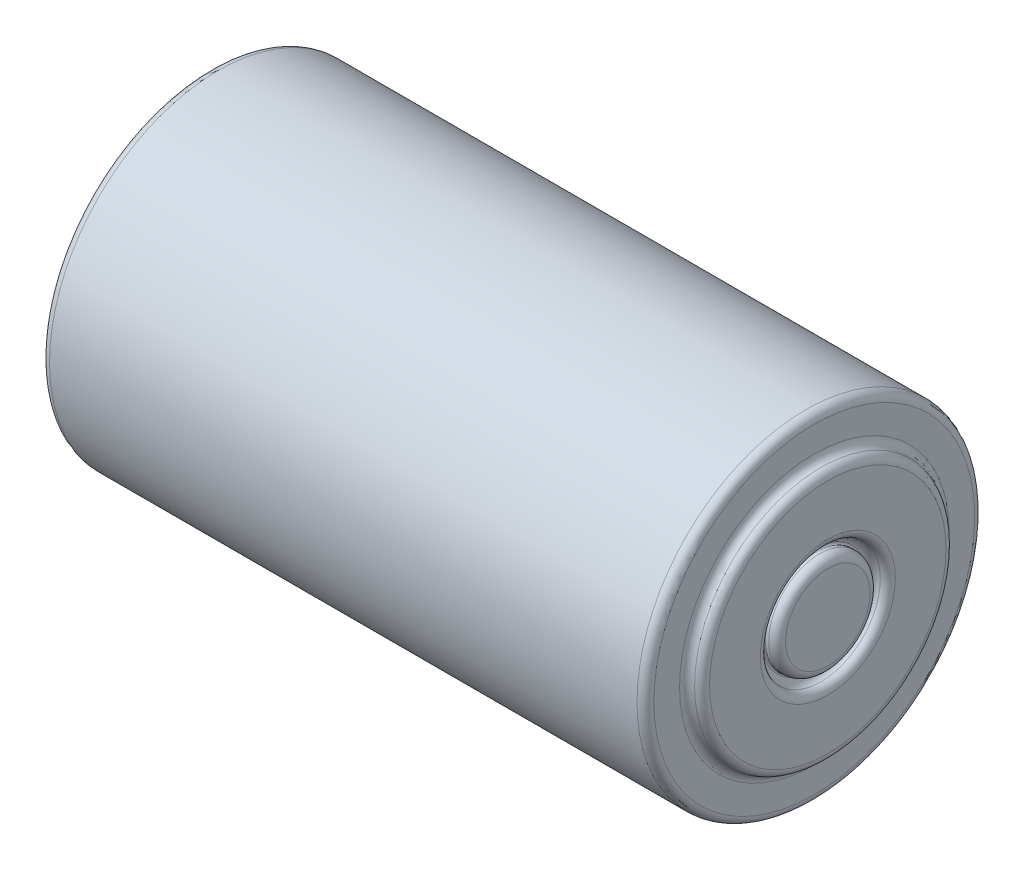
ISO-10303-21;
HEADER;
FILE_DESCRIPTION(('STEP AP214'),'2;1');
FILE_NAME('part.step','',(''),(''),'','','');
FILE_SCHEMA(('AUTOMOTIVE_DESIGN { 1 0 10303 214 1 1 1 1 }'));
ENDSEC;
DATA;
#1=APPLICATION_CONTEXT('core data for automotive mechanical design processes');
#2=APPLICATION_PROTOCOL_DEFINITION('international standard','automotive_design',2000,#1);
#3=PRODUCT_CONTEXT('',#1,'mechanical');
#4=PRODUCT('Part','Part','',(#3));
#5=PRODUCT_RELATED_PRODUCT_CATEGORY('part','',(#4));
#6=PRODUCT_DEFINITION_FORMATION('','',#4);
#7=PRODUCT_DEFINITION_CONTEXT('part definition',#1,'design');
#8=PRODUCT_DEFINITION('design','',#6,#7);
#9=PRODUCT_DEFINITION_SHAPE('','',#8);
#10=(LENGTH_UNIT() NAMED_UNIT(*) SI_UNIT(.MILLI.,.METRE.));
#11=(NAMED_UNIT(*) PLANE_ANGLE_UNIT() SI_UNIT($,.RADIAN.));
#12=(NAMED_UNIT(*) SI_UNIT($,.STERADIAN.) SOLID_ANGLE_UNIT());
#13=UNCERTAINTY_MEASURE_WITH_UNIT(LENGTH_MEASURE(1.E-05),#10,'distance_accuracy_value','');
#14=(GEOMETRIC_REPRESENTATION_CONTEXT(3) GLOBAL_UNCERTAINTY_ASSIGNED_CONTEXT((#13)) GLOBAL_UNIT_ASSIGNED_CONTEXT((#10,
#11,#12)) REPRESENTATION_CONTEXT('',''));
#15=CARTESIAN_POINT('',(0.,0.,0.));
#16=DIRECTION('',(0.,0.,1.));
#17=DIRECTION('',(1.,0.,0.));
#18=AXIS2_PLACEMENT_3D('',#15,#16,#17);
#19=CARTESIAN_POINT('',(45.466,0.,0.));
#20=DIRECTION('',(-1.,0.,0.));
#21=DIRECTION('',(0.,0.,1.));
#22=AXIS2_PLACEMENT_3D('',#19,#20,#21);
#23=PLANE('',#22);
#24=CARTESIAN_POINT('',(45.466,0.,0.));
#25=DIRECTION('',(-1.,0.,0.));
#26=DIRECTION('',(0.,0.,1.));
#27=AXIS2_PLACEMENT_3D('',#24,#25,#26);
#28=CIRCLE('',#27,10.1343407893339);
#29=CARTESIAN_POINT('',(45.466,0.,10.1343407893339));
#30=VERTEX_POINT('',#29);
#31=EDGE_CURVE('E41',#30,#30,#28,.T.);
#32=ORIENTED_EDGE('',*,*,#31,.T.);
#33=EDGE_LOOP('',(#32));
#34=FACE_BOUND('',#33,.T.);
#35=CARTESIAN_POINT('',(45.466,0.,0.));
#36=DIRECTION('',(-1.,0.,0.));
#37=DIRECTION('',(0.,0.,1.));
#38=AXIS2_PLACEMENT_3D('',#35,#36,#37);
#39=CIRCLE('',#38,12.065);
#40=CARTESIAN_POINT('',(45.466,0.,12.065));
#41=VERTEX_POINT('',#40);
#42=EDGE_CURVE('E59',#41,#41,#39,.F.);
#43=ORIENTED_EDGE('',*,*,#42,.T.);
#44=EDGE_LOOP('',(#43));
#45=FACE_BOUND('',#44,.T.);
#46=ADVANCED_FACE('F30',(#34,#45),#23,.F.);
#47=CARTESIAN_POINT('',(0.,12.7,0.));
#48=DIRECTION('',(1.,0.,0.));
#49=DIRECTION('',(0.,0.,-1.));
#50=AXIS2_PLACEMENT_3D('',#47,#48,#49);
#51=PLANE('',#50);
#52=CARTESIAN_POINT('',(0.,0.,0.));
#53=DIRECTION('',(1.,0.,0.));
#54=DIRECTION('',(0.,0.,-1.));
#55=AXIS2_PLACEMENT_3D('',#52,#53,#54);
#56=CIRCLE('',#55,3.937);
#57=CARTESIAN_POINT('',(0.,0.,-3.937));
#58=VERTEX_POINT('',#57);
#59=EDGE_CURVE('E74',#58,#58,#56,.T.);
#60=ORIENTED_EDGE('',*,*,#59,.T.);
#61=EDGE_LOOP('',(#60));
#62=FACE_BOUND('',#61,.T.);
#63=CARTESIAN_POINT('',(0.,0.,0.));
#64=DIRECTION('',(-1.,0.,0.));
#65=DIRECTION('',(0.,0.,1.));
#66=AXIS2_PLACEMENT_3D('',#63,#64,#65);
#67=CIRCLE('',#66,6.604);
#68=CARTESIAN_POINT('',(0.,0.,6.604));
#69=VERTEX_POINT('',#68);
#70=EDGE_CURVE('E98',#69,#69,#67,.T.);
#71=ORIENTED_EDGE('',*,*,#70,.T.);
#72=EDGE_LOOP('',(#71));
#73=FACE_BOUND('',#72,.T.);
#74=ADVANCED_FACE('F32',(#62,#73),#51,.F.);
#75=CARTESIAN_POINT('',(0.,0.,0.));
#76=DIRECTION('',(1.,0.,0.));
#77=DIRECTION('',(0.,0.,-1.));
#78=AXIS2_PLACEMENT_3D('',#75,#76,#77);
#79=CIRCLE('',#78,12.065);
#80=CARTESIAN_POINT('',(0.,0.,-12.065));
#81=VERTEX_POINT('',#80);
#82=EDGE_CURVE('E92',#81,#81,#79,.F.);
#83=ORIENTED_EDGE('',*,*,#82,.T.);
#84=EDGE_LOOP('',(#83));
#85=FACE_BOUND('',#84,.T.);
#86=CARTESIAN_POINT('',(0.,0.,0.));
#87=DIRECTION('',(-1.,0.,0.));
#88=DIRECTION('',(0.,0.,1.));
#89=AXIS2_PLACEMENT_3D('',#86,#87,#88);
#90=CIRCLE('',#89,8.128);
#91=CARTESIAN_POINT('',(0.,0.,8.128));
#92=VERTEX_POINT('',#91);
#93=EDGE_CURVE('E95',#92,#92,#90,.T.);
#94=ORIENTED_EDGE('',*,*,#93,.F.);
#95=EDGE_LOOP('',(#94));
#96=FACE_BOUND('',#95,.T.);
#97=ADVANCED_FACE('F126',(#85,#96),#51,.F.);
#98=CARTESIAN_POINT('',(-20.,0.,0.));
#99=DIRECTION('',(-1.,0.,0.));
#100=DIRECTION('',(0.,0.,1.));
#101=AXIS2_PLACEMENT_3D('',#98,#99,#100);
#102=CYLINDRICAL_SURFACE('',#101,12.7);
#103=CARTESIAN_POINT('',(44.831,0.,0.));
#104=DIRECTION('',(-1.,0.,0.));
#105=DIRECTION('',(0.,0.,1.));
#106=AXIS2_PLACEMENT_3D('',#103,#104,#105);
#107=CIRCLE('',#106,12.7);
#108=CARTESIAN_POINT('',(44.831,0.,12.7));
#109=VERTEX_POINT('',#108);
#110=EDGE_CURVE('E62',#109,#109,#107,.T.);
#111=ORIENTED_EDGE('',*,*,#110,.T.);
#112=EDGE_LOOP('',(#111));
#113=FACE_BOUND('',#112,.T.);
#114=CARTESIAN_POINT('',(0.635000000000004,0.,0.));
#115=DIRECTION('',(1.,0.,0.));
#116=DIRECTION('',(0.,0.,-1.));
#117=AXIS2_PLACEMENT_3D('',#114,#115,#116);
#118=CIRCLE('',#117,12.7);
#119=CARTESIAN_POINT('',(0.635000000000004,0.,-12.7));
#120=VERTEX_POINT('',#119);
#121=EDGE_CURVE('E89',#120,#120,#118,.T.);
#122=ORIENTED_EDGE('',*,*,#121,.T.);
#123=EDGE_LOOP('',(#122));
#124=FACE_BOUND('',#123,.T.);
#125=ADVANCED_FACE('F132',(#113,#124),#102,.T.);
#126=CARTESIAN_POINT('',(-0.508,0.,0.));
#127=DIRECTION('',(-1.,0.,0.));
#128=DIRECTION('',(0.,0.,1.));
#129=AXIS2_PLACEMENT_3D('',#126,#127,#128);
#130=PLANE('',#129);
#131=CARTESIAN_POINT('',(-0.508,0.,0.));
#132=DIRECTION('',(-1.,0.,0.));
#133=DIRECTION('',(0.,0.,1.));
#134=AXIS2_PLACEMENT_3D('',#131,#132,#133);
#135=CIRCLE('',#134,7.50582960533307);
#136=CARTESIAN_POINT('',(-0.508,0.,7.50582960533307));
#137=VERTEX_POINT('',#136);
#138=EDGE_CURVE('E83',#137,#137,#135,.T.);
#139=ORIENTED_EDGE('',*,*,#138,.T.);
#140=EDGE_LOOP('',(#139));
#141=FACE_BOUND('',#140,.T.);
#142=CARTESIAN_POINT('',(-0.508,0.,0.));
#143=DIRECTION('',(-1.,0.,0.));
#144=DIRECTION('',(0.,0.,1.));
#145=AXIS2_PLACEMENT_3D('',#142,#143,#144);
#146=CIRCLE('',#145,7.22617039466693);
#147=CARTESIAN_POINT('',(-0.508,0.,7.22617039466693));
#148=VERTEX_POINT('',#147);
#149=EDGE_CURVE('E86',#148,#148,#146,.F.);
#150=ORIENTED_EDGE('',*,*,#149,.T.);
#151=EDGE_LOOP('',(#150));
#152=FACE_BOUND('',#151,.T.);
#153=ADVANCED_FACE('F130',(#141,#152),#130,.T.);
#154=CARTESIAN_POINT('',(-2.54,0.,0.));
#155=DIRECTION('',(1.,0.,0.));
#156=DIRECTION('',(0.,0.,-1.));
#157=AXIS2_PLACEMENT_3D('',#154,#155,#156);
#158=CYLINDRICAL_SURFACE('',#157,3.302);
#159=CARTESIAN_POINT('',(-0.634999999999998,0.,0.));
#160=DIRECTION('',(1.,0.,0.));
#161=DIRECTION('',(0.,0.,-1.));
#162=AXIS2_PLACEMENT_3D('',#159,#160,#161);
#163=CIRCLE('',#162,3.302);
#164=CARTESIAN_POINT('',(-0.634999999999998,0.,-3.302));
#165=VERTEX_POINT('',#164);
#166=EDGE_CURVE('E77',#165,#165,#163,.F.);
#167=ORIENTED_EDGE('',*,*,#166,.T.);
#168=EDGE_LOOP('',(#167));
#169=FACE_BOUND('',#168,.T.);
#170=CARTESIAN_POINT('',(-1.905,0.,0.));
#171=DIRECTION('',(-1.,0.,0.));
#172=DIRECTION('',(0.,0.,1.));
#173=AXIS2_PLACEMENT_3D('',#170,#171,#172);
#174=CIRCLE('',#173,3.302);
#175=CARTESIAN_POINT('',(-1.905,0.,3.302));
#176=VERTEX_POINT('',#175);
#177=EDGE_CURVE('E80',#176,#176,#174,.F.);
#178=ORIENTED_EDGE('',*,*,#177,.T.);
#179=EDGE_LOOP('',(#178));
#180=FACE_BOUND('',#179,.T.);
#181=ADVANCED_FACE('F139',(#169,#180),#158,.T.);
#182=CARTESIAN_POINT('',(-2.54,0.,0.));
#183=DIRECTION('',(-1.,0.,0.));
#184=DIRECTION('',(0.,0.,1.));
#185=AXIS2_PLACEMENT_3D('',#182,#183,#184);
#186=PLANE('',#185);
#187=CARTESIAN_POINT('',(-2.54,0.,0.));
#188=DIRECTION('',(-1.,0.,0.));
#189=DIRECTION('',(0.,0.,1.));
#190=AXIS2_PLACEMENT_3D('',#187,#188,#189);
#191=CIRCLE('',#190,2.667);
#192=CARTESIAN_POINT('',(-2.54,0.,2.667));
#193=VERTEX_POINT('',#192);
#194=EDGE_CURVE('E71',#193,#193,#191,.T.);
#195=ORIENTED_EDGE('',*,*,#194,.T.);
#196=EDGE_LOOP('',(#195));
#197=FACE_BOUND('',#196,.T.);
#198=ADVANCED_FACE('F141',(#197),#186,.T.);
#199=CARTESIAN_POINT('',(46.482,0.,0.));
#200=DIRECTION('',(1.,0.,0.));
#201=DIRECTION('',(0.,0.,-1.));
#202=AXIS2_PLACEMENT_3D('',#199,#200,#201);
#203=PLANE('',#202);
#204=CARTESIAN_POINT('',(46.482,0.,0.));
#205=DIRECTION('',(1.,0.,0.));
#206=DIRECTION('',(0.,0.,-1.));
#207=AXIS2_PLACEMENT_3D('',#204,#205,#206);
#208=CIRCLE('',#207,8.89);
#209=CARTESIAN_POINT('',(46.482,0.,-8.89));
#210=VERTEX_POINT('',#209);
#211=EDGE_CURVE('E53',#210,#210,#208,.T.);
#212=ORIENTED_EDGE('',*,*,#211,.T.);
#213=EDGE_LOOP('',(#212));
#214=FACE_BOUND('',#213,.T.);
#215=CARTESIAN_POINT('',(46.482,0.,0.));
#216=DIRECTION('',(1.,0.,0.));
#217=DIRECTION('',(0.,0.,-1.));
#218=AXIS2_PLACEMENT_3D('',#215,#216,#217);
#219=CIRCLE('',#218,5.08);
#220=CARTESIAN_POINT('',(46.482,0.,-5.08));
#221=VERTEX_POINT('',#220);
#222=EDGE_CURVE('E56',#221,#221,#219,.F.);
#223=ORIENTED_EDGE('',*,*,#222,.T.);
#224=EDGE_LOOP('',(#223));
#225=FACE_BOUND('',#224,.T.);
#226=ADVANCED_FACE('F163',(#214,#225),#203,.T.);
#227=CARTESIAN_POINT('',(46.482,0.,0.));
#228=DIRECTION('',(-1.,0.,0.));
#229=DIRECTION('',(0.,0.,1.));
#230=AXIS2_PLACEMENT_3D('',#227,#228,#229);
#231=CYLINDRICAL_SURFACE('',#230,3.81);
#232=CARTESIAN_POINT('',(45.6032108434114,0.,0.));
#233=DIRECTION('',(1.,0.,0.));
#234=DIRECTION('',(0.,0.,-1.));
#235=AXIS2_PLACEMENT_3D('',#232,#233,#234);
#236=CIRCLE('',#235,3.81);
#237=CARTESIAN_POINT('',(45.6032108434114,0.,-3.81));
#238=VERTEX_POINT('',#237);
#239=EDGE_CURVE('E37',#238,#238,#236,.T.);
#240=ORIENTED_EDGE('',*,*,#239,.T.);
#241=EDGE_LOOP('',(#240));
#242=FACE_BOUND('',#241,.T.);
#243=CARTESIAN_POINT('',(45.847,0.,0.));
#244=DIRECTION('',(1.,0.,0.));
#245=DIRECTION('',(0.,0.,-1.));
#246=AXIS2_PLACEMENT_3D('',#243,#244,#245);
#247=CIRCLE('',#246,3.81);
#248=CARTESIAN_POINT('',(45.847,0.,-3.81));
#249=VERTEX_POINT('',#248);
#250=EDGE_CURVE('E65',#249,#249,#247,.F.);
#251=ORIENTED_EDGE('',*,*,#250,.T.);
#252=EDGE_LOOP('',(#251));
#253=FACE_BOUND('',#252,.T.);
#254=ADVANCED_FACE('F151',(#242,#253),#231,.T.);
#255=CARTESIAN_POINT('',(46.482,0.,0.));
#256=DIRECTION('',(1.,0.,0.));
#257=DIRECTION('',(0.,0.,-1.));
#258=AXIS2_PLACEMENT_3D('',#255,#256,#257);
#259=PLANE('',#258);
#260=CARTESIAN_POINT('',(46.482,0.,0.));
#261=DIRECTION('',(1.,0.,0.));
#262=DIRECTION('',(0.,0.,-1.));
#263=AXIS2_PLACEMENT_3D('',#260,#261,#262);
#264=CIRCLE('',#263,3.175);
#265=CARTESIAN_POINT('',(46.482,0.,-3.175));
#266=VERTEX_POINT('',#265);
#267=EDGE_CURVE('E68',#266,#266,#264,.T.);
#268=ORIENTED_EDGE('',*,*,#267,.T.);
#269=EDGE_LOOP('',(#268));
#270=FACE_BOUND('',#269,.T.);
#271=ADVANCED_FACE('F149',(#270),#259,.T.);
#272=CARTESIAN_POINT('',(0.635000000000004,0.,0.));
#273=DIRECTION('',(1.,0.,0.));
#274=DIRECTION('',(0.,0.,-1.));
#275=AXIS2_PLACEMENT_3D('',#272,#273,#274);
#276=TOROIDAL_SURFACE('',#275,12.065,0.635);
#277=ORIENTED_EDGE('',*,*,#121,.F.);
#278=EDGE_LOOP('',(#277));
#279=FACE_BOUND('',#278,.T.);
#280=ORIENTED_EDGE('',*,*,#82,.F.);
#281=EDGE_LOOP('',(#280));
#282=FACE_BOUND('',#281,.T.);
#283=ADVANCED_FACE('F116',(#279,#282),#276,.T.);
#284=CARTESIAN_POINT('',(0.127,0.,0.));
#285=DIRECTION('',(1.,0.,0.));
#286=DIRECTION('',(0.,0.,-1.));
#287=AXIS2_PLACEMENT_3D('',#284,#285,#286);
#288=TOROIDAL_SURFACE('',#287,7.50582960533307,0.635);
#289=ORIENTED_EDGE('',*,*,#93,.T.);
#290=EDGE_LOOP('',(#289));
#291=FACE_BOUND('',#290,.T.);
#292=ORIENTED_EDGE('',*,*,#138,.F.);
#293=EDGE_LOOP('',(#292));
#294=FACE_BOUND('',#293,.T.);
#295=ADVANCED_FACE('F106',(#291,#294),#288,.T.);
#296=CARTESIAN_POINT('',(0.127,0.,0.));
#297=DIRECTION('',(-1.,0.,0.));
#298=DIRECTION('',(0.,0.,1.));
#299=AXIS2_PLACEMENT_3D('',#296,#297,#298);
#300=TOROIDAL_SURFACE('',#299,7.22617039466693,0.635);
#301=ORIENTED_EDGE('',*,*,#149,.F.);
#302=EDGE_LOOP('',(#301));
#303=FACE_BOUND('',#302,.T.);
#304=ORIENTED_EDGE('',*,*,#70,.F.);
#305=EDGE_LOOP('',(#304));
#306=FACE_BOUND('',#305,.T.);
#307=ADVANCED_FACE('F103',(#303,#306),#300,.T.);
#308=CARTESIAN_POINT('',(-0.634999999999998,0.,0.));
#309=DIRECTION('',(1.,0.,0.));
#310=DIRECTION('',(0.,0.,-1.));
#311=AXIS2_PLACEMENT_3D('',#308,#309,#310);
#312=TOROIDAL_SURFACE('',#311,3.937,0.635);
#313=ORIENTED_EDGE('',*,*,#59,.F.);
#314=EDGE_LOOP('',(#313));
#315=FACE_BOUND('',#314,.T.);
#316=ORIENTED_EDGE('',*,*,#166,.F.);
#317=EDGE_LOOP('',(#316));
#318=FACE_BOUND('',#317,.T.);
#319=ADVANCED_FACE('F105',(#315,#318),#312,.F.);
#320=CARTESIAN_POINT('',(-1.905,0.,0.));
#321=DIRECTION('',(-1.,0.,0.));
#322=DIRECTION('',(0.,0.,1.));
#323=AXIS2_PLACEMENT_3D('',#320,#321,#322);
#324=TOROIDAL_SURFACE('',#323,2.667,0.635);
#325=ORIENTED_EDGE('',*,*,#177,.F.);
#326=EDGE_LOOP('',(#325));
#327=FACE_BOUND('',#326,.T.);
#328=ORIENTED_EDGE('',*,*,#194,.F.);
#329=EDGE_LOOP('',(#328));
#330=FACE_BOUND('',#329,.T.);
#331=ADVANCED_FACE('F113',(#327,#330),#324,.T.);
#332=CARTESIAN_POINT('',(45.847,0.,0.));
#333=DIRECTION('',(1.,0.,0.));
#334=DIRECTION('',(0.,0.,-1.));
#335=AXIS2_PLACEMENT_3D('',#332,#333,#334);
#336=TOROIDAL_SURFACE('',#335,3.175,0.635);
#337=ORIENTED_EDGE('',*,*,#250,.F.);
#338=EDGE_LOOP('',(#337));
#339=FACE_BOUND('',#338,.T.);
#340=ORIENTED_EDGE('',*,*,#267,.F.);
#341=EDGE_LOOP('',(#340));
#342=FACE_BOUND('',#341,.T.);
#343=ADVANCED_FACE('F185',(#339,#342),#336,.T.);
#344=CARTESIAN_POINT('',(44.831,0.,0.));
#345=DIRECTION('',(-1.,0.,0.));
#346=DIRECTION('',(0.,0.,1.));
#347=AXIS2_PLACEMENT_3D('',#344,#345,#346);
#348=TOROIDAL_SURFACE('',#347,12.065,0.635);
#349=ORIENTED_EDGE('',*,*,#42,.F.);
#350=EDGE_LOOP('',(#349));
#351=FACE_BOUND('',#350,.T.);
#352=ORIENTED_EDGE('',*,*,#110,.F.);
#353=EDGE_LOOP('',(#352));
#354=FACE_BOUND('',#353,.T.);
#355=ADVANCED_FACE('F191',(#351,#354),#348,.T.);
#356=CARTESIAN_POINT('',(45.847,0.,0.));
#357=DIRECTION('',(1.,0.,0.));
#358=DIRECTION('',(0.,0.,-1.));
#359=AXIS2_PLACEMENT_3D('',#356,#357,#358);
#360=TOROIDAL_SURFACE('',#359,8.89,0.635);
#361=CARTESIAN_POINT('',(45.974,0.,0.));
#362=DIRECTION('',(-1.,0.,0.));
#363=DIRECTION('',(0.,0.,1.));
#364=AXIS2_PLACEMENT_3D('',#361,#362,#363);
#365=CIRCLE('',#364,9.51217039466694);
#366=CARTESIAN_POINT('',(45.974,0.,9.51217039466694));
#367=VERTEX_POINT('',#366);
#368=EDGE_CURVE('E45',#367,#367,#365,.F.);
#369=ORIENTED_EDGE('',*,*,#368,.T.);
#370=EDGE_LOOP('',(#369));
#371=FACE_BOUND('',#370,.T.);
#372=ORIENTED_EDGE('',*,*,#211,.F.);
#373=EDGE_LOOP('',(#372));
#374=FACE_BOUND('',#373,.T.);
#375=ADVANCED_FACE('F197',(#371,#374),#360,.T.);
#376=CARTESIAN_POINT('',(45.847,0.,0.));
#377=DIRECTION('',(1.,0.,0.));
#378=DIRECTION('',(0.,0.,-1.));
#379=AXIS2_PLACEMENT_3D('',#376,#377,#378);
#380=TOROIDAL_SURFACE('',#379,5.08,0.635);
#381=CARTESIAN_POINT('',(45.974,0.,0.));
#382=DIRECTION('',(-1.,0.,0.));
#383=DIRECTION('',(0.,0.,1.));
#384=AXIS2_PLACEMENT_3D('',#381,#382,#383);
#385=CIRCLE('',#384,4.45782960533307);
#386=CARTESIAN_POINT('',(45.974,0.,4.45782960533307));
#387=VERTEX_POINT('',#386);
#388=EDGE_CURVE('E50',#387,#387,#385,.T.);
#389=ORIENTED_EDGE('',*,*,#388,.T.);
#390=EDGE_LOOP('',(#389));
#391=FACE_BOUND('',#390,.T.);
#392=ORIENTED_EDGE('',*,*,#222,.F.);
#393=EDGE_LOOP('',(#392));
#394=FACE_BOUND('',#393,.T.);
#395=ADVANCED_FACE('F201',(#391,#394),#380,.T.);
#396=CARTESIAN_POINT('',(46.101,0.,0.));
#397=DIRECTION('',(1.,0.,0.));
#398=DIRECTION('',(0.,0.,-1.));
#399=AXIS2_PLACEMENT_3D('',#396,#397,#398);
#400=TOROIDAL_SURFACE('',#399,3.83565921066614,0.635);
#401=CARTESIAN_POINT('',(45.4787635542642,0.,0.));
#402=DIRECTION('',(1.,0.,0.));
#403=DIRECTION('',(0.,0.,-1.));
#404=AXIS2_PLACEMENT_3D('',#401,#402,#403);
#405=CIRCLE('',#404,3.96233519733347);
#406=CARTESIAN_POINT('',(45.4787635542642,0.,-3.96233519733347));
#407=VERTEX_POINT('',#406);
#408=EDGE_CURVE('E10',#407,#407,#405,.F.);
#409=ORIENTED_EDGE('',*,*,#408,.T.);
#410=EDGE_LOOP('',(#409));
#411=FACE_BOUND('',#410,.T.);
#412=ORIENTED_EDGE('',*,*,#388,.F.);
#413=EDGE_LOOP('',(#412));
#414=FACE_BOUND('',#413,.T.);
#415=ADVANCED_FACE('F205',(#411,#414),#400,.F.);
#416=CARTESIAN_POINT('',(46.101,0.,0.));
#417=DIRECTION('',(-1.,0.,0.));
#418=DIRECTION('',(0.,0.,1.));
#419=AXIS2_PLACEMENT_3D('',#416,#417,#418);
#420=TOROIDAL_SURFACE('',#419,10.1343407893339,0.635);
#421=ORIENTED_EDGE('',*,*,#31,.F.);
#422=EDGE_LOOP('',(#421));
#423=FACE_BOUND('',#422,.T.);
#424=ORIENTED_EDGE('',*,*,#368,.F.);
#425=EDGE_LOOP('',(#424));
#426=FACE_BOUND('',#425,.T.);
#427=ADVANCED_FACE('F209',(#423,#426),#420,.F.);
#428=CARTESIAN_POINT('',(45.6032108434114,0.,0.));
#429=DIRECTION('',(1.,0.,0.));
#430=DIRECTION('',(0.,0.,-1.));
#431=AXIS2_PLACEMENT_3D('',#428,#429,#430);
#432=TOROIDAL_SURFACE('',#431,3.937,0.127);
#433=ORIENTED_EDGE('',*,*,#408,.F.);
#434=EDGE_LOOP('',(#433));
#435=FACE_BOUND('',#434,.T.);
#436=ORIENTED_EDGE('',*,*,#239,.F.);
#437=EDGE_LOOP('',(#436));
#438=FACE_BOUND('',#437,.T.);
#439=ADVANCED_FACE('F212',(#435,#438),#432,.F.);
#440=CLOSED_SHELL('',(#46,#74,#97,#125,#153,#181,#198,#226,#254,#271,#283,#295,#307,#319,#331,
#343,#355,#375,#395,#415,#427,#439));
#441=MANIFOLD_SOLID_BREP('B2',#440);
#442=ADVANCED_BREP_SHAPE_REPRESENTATION('',(#18,#441),#14);
#443=SHAPE_DEFINITION_REPRESENTATION(#9,#442);
ENDSEC;
END-ISO-10303-21;
